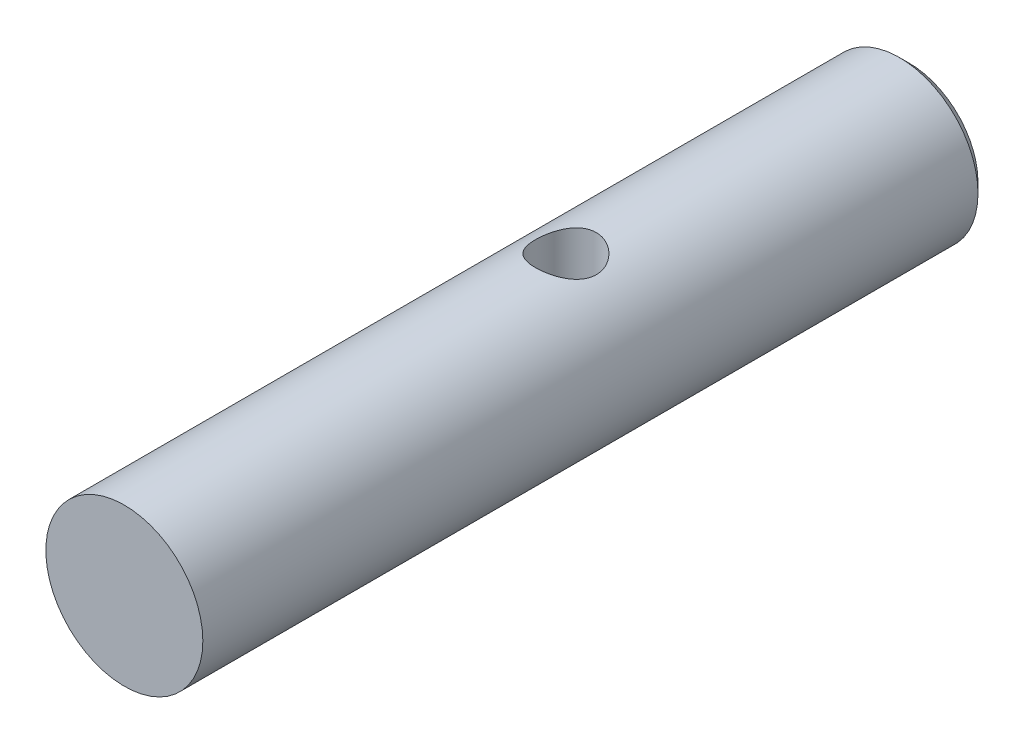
ISO-10303-21;
HEADER;
FILE_DESCRIPTION(('STEP AP214'),'2;1');
FILE_NAME('part.step','',(''),(''),'','','');
FILE_SCHEMA(('AUTOMOTIVE_DESIGN { 1 0 10303 214 1 1 1 1 }'));
ENDSEC;
DATA;
#1=APPLICATION_CONTEXT('core data for automotive mechanical design processes');
#2=APPLICATION_PROTOCOL_DEFINITION('international standard','automotive_design',2000,#1);
#3=PRODUCT_CONTEXT('',#1,'mechanical');
#4=PRODUCT('Part','Part','',(#3));
#5=PRODUCT_RELATED_PRODUCT_CATEGORY('part','',(#4));
#6=PRODUCT_DEFINITION_FORMATION('','',#4);
#7=PRODUCT_DEFINITION_CONTEXT('part definition',#1,'design');
#8=PRODUCT_DEFINITION('design','',#6,#7);
#9=PRODUCT_DEFINITION_SHAPE('','',#8);
#10=(LENGTH_UNIT() NAMED_UNIT(*) SI_UNIT(.MILLI.,.METRE.));
#11=(NAMED_UNIT(*) PLANE_ANGLE_UNIT() SI_UNIT($,.RADIAN.));
#12=(NAMED_UNIT(*) SI_UNIT($,.STERADIAN.) SOLID_ANGLE_UNIT());
#13=UNCERTAINTY_MEASURE_WITH_UNIT(LENGTH_MEASURE(1.E-05),#10,'distance_accuracy_value','');
#14=(GEOMETRIC_REPRESENTATION_CONTEXT(3) GLOBAL_UNCERTAINTY_ASSIGNED_CONTEXT((#13)) GLOBAL_UNIT_ASSIGNED_CONTEXT((#10,
#11,#12)) REPRESENTATION_CONTEXT('',''));
#15=CARTESIAN_POINT('',(0.,0.,0.));
#16=DIRECTION('',(0.,0.,1.));
#17=DIRECTION('',(1.,0.,0.));
#18=AXIS2_PLACEMENT_3D('',#15,#16,#17);
#19=CARTESIAN_POINT('',(0.,0.,40.));
#20=DIRECTION('',(0.,0.,-1.));
#21=DIRECTION('',(-1.,0.,0.));
#22=AXIS2_PLACEMENT_3D('',#19,#20,#21);
#23=CYLINDRICAL_SURFACE('',#22,4.);
#24=CARTESIAN_POINT('',(0.,-4.,19.05));
#25=CARTESIAN_POINT('',(0.0837418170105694,-4.00000307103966,19.0500040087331));
#26=CARTESIAN_POINT('',(0.167457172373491,-3.9973478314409,19.0431926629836));
#27=CARTESIAN_POINT('',(0.332375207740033,-3.98702237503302,19.0162464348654));
#28=CARTESIAN_POINT('',(0.413578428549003,-3.97935324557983,18.9961144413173));
#29=CARTESIAN_POINT('',(0.571068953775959,-3.95981985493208,18.9433531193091));
#30=CARTESIAN_POINT('',(0.647365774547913,-3.94796402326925,18.9107488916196));
#31=CARTESIAN_POINT('',(0.793397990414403,-3.92122905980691,18.8341007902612));
#32=CARTESIAN_POINT('',(0.86313149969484,-3.9063490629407,18.7900536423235));
#33=CARTESIAN_POINT('',(0.997188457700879,-3.8743461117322,18.689708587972));
#34=CARTESIAN_POINT('',(1.06117882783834,-3.85715676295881,18.6329870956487));
#35=CARTESIAN_POINT('',(1.17901131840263,-3.82278777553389,18.5098027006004));
#36=CARTESIAN_POINT('',(1.23285001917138,-3.80560814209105,18.4433365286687));
#37=CARTESIAN_POINT('',(1.33104129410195,-3.77241707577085,18.2992114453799));
#38=CARTESIAN_POINT('',(1.37491107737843,-3.75648304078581,18.2212039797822));
#39=CARTESIAN_POINT('',(1.44875905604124,-3.7286279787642,18.0582048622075));
#40=CARTESIAN_POINT('',(1.47874322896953,-3.71670522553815,17.9732162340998));
#41=CARTESIAN_POINT('',(1.52263359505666,-3.69893619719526,17.8025108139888));
#42=CARTESIAN_POINT('',(1.53717845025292,-3.69284964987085,17.7169841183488));
#43=CARTESIAN_POINT('',(1.55177347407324,-3.686742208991,17.5445039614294));
#44=CARTESIAN_POINT('',(1.55183016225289,-3.6867185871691,17.4575511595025));
#45=CARTESIAN_POINT('',(1.53793335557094,-3.69253360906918,17.2906718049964));
#46=CARTESIAN_POINT('',(1.52488463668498,-3.69799366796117,17.210654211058));
#47=CARTESIAN_POINT('',(1.48664952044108,-3.71352858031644,17.0540485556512));
#48=CARTESIAN_POINT('',(1.46146116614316,-3.72360417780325,16.977461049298));
#49=CARTESIAN_POINT('',(1.39919376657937,-3.74745019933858,16.8281119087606));
#50=CARTESIAN_POINT('',(1.36189037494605,-3.76128946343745,16.7554552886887));
#51=CARTESIAN_POINT('',(1.27660867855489,-3.79108253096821,16.6171778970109));
#52=CARTESIAN_POINT('',(1.22862651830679,-3.80703709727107,16.5515596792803));
#53=CARTESIAN_POINT('',(1.1192765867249,-3.84066621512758,16.4242405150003));
#54=CARTESIAN_POINT('',(1.05719282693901,-3.85838181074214,16.3631637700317));
#55=CARTESIAN_POINT('',(0.923467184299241,-3.89255270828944,16.2520960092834));
#56=CARTESIAN_POINT('',(0.851823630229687,-3.90900778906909,16.2021069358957));
#57=CARTESIAN_POINT('',(0.699332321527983,-3.93917140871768,16.1138816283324));
#58=CARTESIAN_POINT('',(0.618345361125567,-3.95282680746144,16.0758665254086));
#59=CARTESIAN_POINT('',(0.4504635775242,-3.97545468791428,16.0142112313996));
#60=CARTESIAN_POINT('',(0.363571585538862,-3.98442939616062,15.9905642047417));
#61=CARTESIAN_POINT('',(0.19158931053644,-3.99628616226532,15.9595469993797));
#62=CARTESIAN_POINT('',(0.106672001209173,-3.99948214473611,15.9513371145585));
#63=CARTESIAN_POINT('',(-0.0633780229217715,-4.0004007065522,15.9489652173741));
#64=CARTESIAN_POINT('',(-0.148510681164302,-3.99812459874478,15.9547998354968));
#65=CARTESIAN_POINT('',(-0.312858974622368,-3.98856115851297,15.9797230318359));
#66=CARTESIAN_POINT('',(-0.392173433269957,-3.98148622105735,15.9982501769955));
#67=CARTESIAN_POINT('',(-0.546503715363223,-3.96325324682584,16.0472811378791));
#68=CARTESIAN_POINT('',(-0.621518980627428,-3.95209468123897,16.0777865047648));
#69=CARTESIAN_POINT('',(-0.767652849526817,-3.92637006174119,16.1508947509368));
#70=CARTESIAN_POINT('',(-0.838586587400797,-3.91171167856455,16.1938336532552));
#71=CARTESIAN_POINT('',(-0.97248588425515,-3.88059327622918,16.2902139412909));
#72=CARTESIAN_POINT('',(-1.03544835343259,-3.86413256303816,16.3436593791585));
#73=CARTESIAN_POINT('',(-1.15570630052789,-3.82994670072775,16.4634276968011));
#74=CARTESIAN_POINT('',(-1.21240855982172,-3.81220642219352,16.5303434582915));
#75=CARTESIAN_POINT('',(-1.31391042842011,-3.7784267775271,16.6730730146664));
#76=CARTESIAN_POINT('',(-1.35870855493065,-3.76238762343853,16.7488879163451));
#77=CARTESIAN_POINT('',(-1.43528626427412,-3.73385097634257,16.9081328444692));
#78=CARTESIAN_POINT('',(-1.46697619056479,-3.72137804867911,16.991610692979));
#79=CARTESIAN_POINT('',(-1.51562246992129,-3.70183589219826,17.1633418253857));
#80=CARTESIAN_POINT('',(-1.53258879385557,-3.69476300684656,17.2515918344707));
#81=CARTESIAN_POINT('',(-1.55038415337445,-3.68732874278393,17.4238860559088));
#82=CARTESIAN_POINT('',(-1.55223359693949,-3.68654305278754,17.5078073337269));
#83=CARTESIAN_POINT('',(-1.54238929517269,-3.69067248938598,17.6747006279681));
#84=CARTESIAN_POINT('',(-1.53069702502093,-3.69558699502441,17.7576727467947));
#85=CARTESIAN_POINT('',(-1.49491544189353,-3.71019928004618,17.9173658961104));
#86=CARTESIAN_POINT('',(-1.471271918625,-3.7197245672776,17.9942039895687));
#87=CARTESIAN_POINT('',(-1.41266354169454,-3.74237408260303,18.1428607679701));
#88=CARTESIAN_POINT('',(-1.37769573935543,-3.7554992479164,18.214678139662));
#89=CARTESIAN_POINT('',(-1.29520837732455,-3.7847652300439,18.3555456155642));
#90=CARTESIAN_POINT('',(-1.24710518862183,-3.80103203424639,18.4242274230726));
#91=CARTESIAN_POINT('',(-1.1405907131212,-3.83434014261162,18.5528684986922));
#92=CARTESIAN_POINT('',(-1.08217604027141,-3.85138169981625,18.6128248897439));
#93=CARTESIAN_POINT('',(-0.952559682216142,-3.88553398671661,18.7259513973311));
#94=CARTESIAN_POINT('',(-0.880804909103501,-3.90258881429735,18.778507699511));
#95=CARTESIAN_POINT('',(-0.728878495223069,-3.93379551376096,18.8708166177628));
#96=CARTESIAN_POINT('',(-0.648705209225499,-3.94794681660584,18.9105667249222));
#97=CARTESIAN_POINT('',(-0.476070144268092,-3.97259068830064,18.978190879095));
#98=CARTESIAN_POINT('',(-0.383139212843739,-3.9827464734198,19.0050038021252));
#99=CARTESIAN_POINT('',(-0.193458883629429,-3.99644738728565,19.0409007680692));
#100=CARTESIAN_POINT('',(-0.0967117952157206,-3.99999645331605,19.0499953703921));
#101=CARTESIAN_POINT('',(0.,-4.,19.05));
#102=B_SPLINE_CURVE_WITH_KNOTS('',3,(#24,#25,#26,#27,#28,#29,#30,#31,#32,#33,#34,#35,#36,#37,
#38,#39,#40,#41,#42,#43,#44,#45,#46,#47,#48,#49,#50,#51,#52,#53,#54,#55,#56,#57,#58,#59,#60,#61,
#62,#63,#64,#65,#66,#67,#68,#69,#70,#71,#72,#73,#74,#75,#76,#77,#78,#79,#80,#81,#82,#83,#84,#85,
#86,#87,#88,#89,#90,#91,#92,#93,#94,#95,#96,#97,#98,#99,#100,#101),.UNSPECIFIED.,.T.,.F.,(4,2,2,
2,2,2,2,2,2,2,2,2,2,2,2,2,2,2,2,2,2,2,2,2,2,2,2,2,2,2,2,2,2,2,2,2,2,2,4),(0.,0.250868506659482,
0.501682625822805,0.751994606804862,1.00237829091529,1.26289324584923,1.52349580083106,
1.79484593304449,2.06607914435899,2.32559405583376,2.58499218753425,2.82763403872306,
3.07031501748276,3.31777403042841,3.56532253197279,3.83073141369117,4.0961867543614,
4.36629046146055,4.63626556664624,4.89107530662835,5.14582391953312,5.38997552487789,
5.63415875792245,5.88568062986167,6.13729969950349,6.40451611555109,6.67176580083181,
6.94081432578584,7.20968050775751,7.46023414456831,7.71076048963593,7.95256448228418,
8.19443148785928,8.44957507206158,8.70480259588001,8.97517525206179,9.245600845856,
9.53549682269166,9.82521998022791),.UNSPECIFIED.);
#103=CARTESIAN_POINT('',(0.,-4.,19.05));
#104=VERTEX_POINT('',#103);
#105=EDGE_CURVE('E10',#104,#104,#102,.T.);
#106=ORIENTED_EDGE('',*,*,#105,.T.);
#107=EDGE_LOOP('',(#106));
#108=FACE_BOUND('',#107,.T.);
#109=CARTESIAN_POINT('',(0.,4.,19.05));
#110=CARTESIAN_POINT('',(-0.0837418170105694,4.00000307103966,19.0500040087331));
#111=CARTESIAN_POINT('',(-0.167457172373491,3.9973478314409,19.0431926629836));
#112=CARTESIAN_POINT('',(-0.332375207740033,3.98702237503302,19.0162464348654));
#113=CARTESIAN_POINT('',(-0.413578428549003,3.97935324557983,18.9961144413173));
#114=CARTESIAN_POINT('',(-0.571068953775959,3.95981985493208,18.9433531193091));
#115=CARTESIAN_POINT('',(-0.647365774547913,3.94796402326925,18.9107488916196));
#116=CARTESIAN_POINT('',(-0.793397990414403,3.92122905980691,18.8341007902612));
#117=CARTESIAN_POINT('',(-0.86313149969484,3.9063490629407,18.7900536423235));
#118=CARTESIAN_POINT('',(-0.997188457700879,3.8743461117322,18.689708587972));
#119=CARTESIAN_POINT('',(-1.06117882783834,3.85715676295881,18.6329870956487));
#120=CARTESIAN_POINT('',(-1.17901131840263,3.82278777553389,18.5098027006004));
#121=CARTESIAN_POINT('',(-1.23285001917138,3.80560814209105,18.4433365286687));
#122=CARTESIAN_POINT('',(-1.33104129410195,3.77241707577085,18.2992114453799));
#123=CARTESIAN_POINT('',(-1.37491107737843,3.75648304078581,18.2212039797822));
#124=CARTESIAN_POINT('',(-1.44875905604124,3.7286279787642,18.0582048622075));
#125=CARTESIAN_POINT('',(-1.47874322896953,3.71670522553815,17.9732162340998));
#126=CARTESIAN_POINT('',(-1.52263359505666,3.69893619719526,17.8025108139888));
#127=CARTESIAN_POINT('',(-1.53717845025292,3.69284964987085,17.7169841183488));
#128=CARTESIAN_POINT('',(-1.55177347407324,3.686742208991,17.5445039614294));
#129=CARTESIAN_POINT('',(-1.55183016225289,3.6867185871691,17.4575511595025));
#130=CARTESIAN_POINT('',(-1.53793335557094,3.69253360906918,17.2906718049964));
#131=CARTESIAN_POINT('',(-1.52488463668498,3.69799366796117,17.210654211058));
#132=CARTESIAN_POINT('',(-1.48664952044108,3.71352858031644,17.0540485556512));
#133=CARTESIAN_POINT('',(-1.46146116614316,3.72360417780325,16.977461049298));
#134=CARTESIAN_POINT('',(-1.39919376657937,3.74745019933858,16.8281119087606));
#135=CARTESIAN_POINT('',(-1.36189037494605,3.76128946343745,16.7554552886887));
#136=CARTESIAN_POINT('',(-1.27660867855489,3.79108253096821,16.6171778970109));
#137=CARTESIAN_POINT('',(-1.22862651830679,3.80703709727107,16.5515596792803));
#138=CARTESIAN_POINT('',(-1.1192765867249,3.84066621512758,16.4242405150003));
#139=CARTESIAN_POINT('',(-1.05719282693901,3.85838181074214,16.3631637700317));
#140=CARTESIAN_POINT('',(-0.923467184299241,3.89255270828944,16.2520960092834));
#141=CARTESIAN_POINT('',(-0.851823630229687,3.90900778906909,16.2021069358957));
#142=CARTESIAN_POINT('',(-0.699332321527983,3.93917140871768,16.1138816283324));
#143=CARTESIAN_POINT('',(-0.618345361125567,3.95282680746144,16.0758665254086));
#144=CARTESIAN_POINT('',(-0.4504635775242,3.97545468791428,16.0142112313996));
#145=CARTESIAN_POINT('',(-0.363571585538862,3.98442939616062,15.9905642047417));
#146=CARTESIAN_POINT('',(-0.19158931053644,3.99628616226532,15.9595469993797));
#147=CARTESIAN_POINT('',(-0.106672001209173,3.99948214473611,15.9513371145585));
#148=CARTESIAN_POINT('',(0.0633780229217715,4.0004007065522,15.9489652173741));
#149=CARTESIAN_POINT('',(0.148510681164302,3.99812459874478,15.9547998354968));
#150=CARTESIAN_POINT('',(0.312858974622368,3.98856115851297,15.9797230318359));
#151=CARTESIAN_POINT('',(0.392173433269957,3.98148622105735,15.9982501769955));
#152=CARTESIAN_POINT('',(0.546503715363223,3.96325324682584,16.0472811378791));
#153=CARTESIAN_POINT('',(0.621518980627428,3.95209468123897,16.0777865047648));
#154=CARTESIAN_POINT('',(0.767652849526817,3.92637006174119,16.1508947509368));
#155=CARTESIAN_POINT('',(0.838586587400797,3.91171167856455,16.1938336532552));
#156=CARTESIAN_POINT('',(0.97248588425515,3.88059327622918,16.2902139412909));
#157=CARTESIAN_POINT('',(1.03544835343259,3.86413256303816,16.3436593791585));
#158=CARTESIAN_POINT('',(1.15570630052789,3.82994670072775,16.4634276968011));
#159=CARTESIAN_POINT('',(1.21240855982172,3.81220642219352,16.5303434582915));
#160=CARTESIAN_POINT('',(1.31391042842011,3.7784267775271,16.6730730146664));
#161=CARTESIAN_POINT('',(1.35870855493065,3.76238762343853,16.7488879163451));
#162=CARTESIAN_POINT('',(1.43528626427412,3.73385097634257,16.9081328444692));
#163=CARTESIAN_POINT('',(1.46697619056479,3.72137804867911,16.991610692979));
#164=CARTESIAN_POINT('',(1.51562246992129,3.70183589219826,17.1633418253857));
#165=CARTESIAN_POINT('',(1.53258879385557,3.69476300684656,17.2515918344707));
#166=CARTESIAN_POINT('',(1.55038415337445,3.68732874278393,17.4238860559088));
#167=CARTESIAN_POINT('',(1.55223359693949,3.68654305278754,17.5078073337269));
#168=CARTESIAN_POINT('',(1.54238929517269,3.69067248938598,17.6747006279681));
#169=CARTESIAN_POINT('',(1.53069702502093,3.69558699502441,17.7576727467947));
#170=CARTESIAN_POINT('',(1.49491544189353,3.71019928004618,17.9173658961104));
#171=CARTESIAN_POINT('',(1.471271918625,3.7197245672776,17.9942039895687));
#172=CARTESIAN_POINT('',(1.41266354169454,3.74237408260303,18.1428607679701));
#173=CARTESIAN_POINT('',(1.37769573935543,3.7554992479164,18.214678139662));
#174=CARTESIAN_POINT('',(1.29520837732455,3.7847652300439,18.3555456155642));
#175=CARTESIAN_POINT('',(1.24710518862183,3.80103203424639,18.4242274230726));
#176=CARTESIAN_POINT('',(1.1405907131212,3.83434014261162,18.5528684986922));
#177=CARTESIAN_POINT('',(1.08217604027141,3.85138169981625,18.6128248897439));
#178=CARTESIAN_POINT('',(0.952559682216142,3.88553398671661,18.7259513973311));
#179=CARTESIAN_POINT('',(0.880804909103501,3.90258881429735,18.778507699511));
#180=CARTESIAN_POINT('',(0.728878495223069,3.93379551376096,18.8708166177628));
#181=CARTESIAN_POINT('',(0.648705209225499,3.94794681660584,18.9105667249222));
#182=CARTESIAN_POINT('',(0.476070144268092,3.97259068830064,18.978190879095));
#183=CARTESIAN_POINT('',(0.383139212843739,3.9827464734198,19.0050038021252));
#184=CARTESIAN_POINT('',(0.193458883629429,3.99644738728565,19.0409007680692));
#185=CARTESIAN_POINT('',(0.0967117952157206,3.99999645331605,19.0499953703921));
#186=CARTESIAN_POINT('',(0.,4.,19.05));
#187=B_SPLINE_CURVE_WITH_KNOTS('',3,(#109,#110,#111,#112,#113,#114,#115,#116,#117,#118,#119,
#120,#121,#122,#123,#124,#125,#126,#127,#128,#129,#130,#131,#132,#133,#134,#135,#136,#137,#138,
#139,#140,#141,#142,#143,#144,#145,#146,#147,#148,#149,#150,#151,#152,#153,#154,#155,#156,#157,
#158,#159,#160,#161,#162,#163,#164,#165,#166,#167,#168,#169,#170,#171,#172,#173,#174,#175,#176,
#177,#178,#179,#180,#181,#182,#183,#184,#185,#186),.UNSPECIFIED.,.T.,.F.,(4,2,2,2,2,2,2,2,2,2,2,
2,2,2,2,2,2,2,2,2,2,2,2,2,2,2,2,2,2,2,2,2,2,2,2,2,2,2,4),(0.,0.250868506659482,
0.501682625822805,0.751994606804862,1.00237829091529,1.26289324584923,1.52349580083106,
1.79484593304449,2.06607914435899,2.32559405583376,2.58499218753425,2.82763403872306,
3.07031501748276,3.31777403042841,3.56532253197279,3.83073141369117,4.0961867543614,
4.36629046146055,4.63626556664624,4.89107530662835,5.14582391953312,5.38997552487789,
5.63415875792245,5.88568062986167,6.13729969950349,6.40451611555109,6.67176580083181,
6.94081432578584,7.20968050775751,7.46023414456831,7.71076048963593,7.95256448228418,
8.19443148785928,8.44957507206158,8.70480259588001,8.97517525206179,9.245600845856,
9.53549682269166,9.82521998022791),.UNSPECIFIED.);
#188=CARTESIAN_POINT('',(0.,4.,19.05));
#189=VERTEX_POINT('',#188);
#190=EDGE_CURVE('E40',#189,#189,#187,.T.);
#191=ORIENTED_EDGE('',*,*,#190,.T.);
#192=EDGE_LOOP('',(#191));
#193=FACE_BOUND('',#192,.T.);
#194=CARTESIAN_POINT('',(0.,0.,0.5));
#195=DIRECTION('',(0.,0.,1.));
#196=DIRECTION('',(1.,0.,0.));
#197=AXIS2_PLACEMENT_3D('',#194,#195,#196);
#198=CIRCLE('',#197,4.);
#199=CARTESIAN_POINT('',(4.,0.,0.5));
#200=VERTEX_POINT('',#199);
#201=EDGE_CURVE('E48',#200,#200,#198,.T.);
#202=ORIENTED_EDGE('',*,*,#201,.T.);
#203=EDGE_LOOP('',(#202));
#204=FACE_BOUND('',#203,.T.);
#205=CARTESIAN_POINT('',(0.,0.,40.));
#206=DIRECTION('',(0.,0.,1.));
#207=DIRECTION('',(1.,0.,0.));
#208=AXIS2_PLACEMENT_3D('',#205,#206,#207);
#209=CIRCLE('',#208,4.);
#210=CARTESIAN_POINT('',(4.,0.,40.));
#211=VERTEX_POINT('',#210);
#212=EDGE_CURVE('E75',#211,#211,#209,.T.);
#213=ORIENTED_EDGE('',*,*,#212,.F.);
#214=EDGE_LOOP('',(#213));
#215=FACE_BOUND('',#214,.T.);
#216=ADVANCED_FACE('F29',(#108,#193,#204,#215),#23,.T.);
#217=CARTESIAN_POINT('',(0.,0.,40.));
#218=DIRECTION('',(0.,0.,1.));
#219=DIRECTION('',(1.,0.,0.));
#220=AXIS2_PLACEMENT_3D('',#217,#218,#219);
#221=PLANE('',#220);
#222=ORIENTED_EDGE('',*,*,#212,.T.);
#223=EDGE_LOOP('',(#222));
#224=FACE_BOUND('',#223,.T.);
#225=ADVANCED_FACE('F66',(#224),#221,.T.);
#226=CARTESIAN_POINT('',(0.,0.,0.));
#227=DIRECTION('',(0.,0.,1.));
#228=DIRECTION('',(1.,0.,0.));
#229=AXIS2_PLACEMENT_3D('',#226,#227,#228);
#230=PLANE('',#229);
#231=CARTESIAN_POINT('',(0.,0.,0.));
#232=DIRECTION('',(0.,0.,1.));
#233=DIRECTION('',(1.,0.,0.));
#234=AXIS2_PLACEMENT_3D('',#231,#232,#233);
#235=CIRCLE('',#234,3.5);
#236=CARTESIAN_POINT('',(3.5,0.,0.));
#237=VERTEX_POINT('',#236);
#238=EDGE_CURVE('E44',#237,#237,#235,.F.);
#239=ORIENTED_EDGE('',*,*,#238,.T.);
#240=EDGE_LOOP('',(#239));
#241=FACE_BOUND('',#240,.T.);
#242=ADVANCED_FACE('F63',(#241),#230,.F.);
#243=CARTESIAN_POINT('',(0.,0.,0.5));
#244=DIRECTION('',(0.,0.,1.));
#245=DIRECTION('',(1.,0.,0.));
#246=AXIS2_PLACEMENT_3D('',#243,#244,#245);
#247=CONICAL_SURFACE('',#246,4.,0.785398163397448);
#248=ORIENTED_EDGE('',*,*,#238,.F.);
#249=EDGE_LOOP('',(#248));
#250=FACE_BOUND('',#249,.T.);
#251=ORIENTED_EDGE('',*,*,#201,.F.);
#252=EDGE_LOOP('',(#251));
#253=FACE_BOUND('',#252,.T.);
#254=ADVANCED_FACE('F58',(#250,#253),#247,.T.);
#255=CARTESIAN_POINT('',(0.,-4.,17.5));
#256=DIRECTION('',(0.,1.,0.));
#257=DIRECTION('',(0.,0.,1.));
#258=AXIS2_PLACEMENT_3D('',#255,#256,#257);
#259=CYLINDRICAL_SURFACE('',#258,1.55);
#260=ORIENTED_EDGE('',*,*,#190,.F.);
#261=EDGE_LOOP('',(#260));
#262=FACE_BOUND('',#261,.T.);
#263=ORIENTED_EDGE('',*,*,#105,.F.);
#264=EDGE_LOOP('',(#263));
#265=FACE_BOUND('',#264,.T.);
#266=ADVANCED_FACE('F54',(#262,#265),#259,.F.);
#267=CLOSED_SHELL('',(#216,#225,#242,#254,#266));
#268=MANIFOLD_SOLID_BREP('B2',#267);
#269=ADVANCED_BREP_SHAPE_REPRESENTATION('',(#18,#268),#14);
#270=SHAPE_DEFINITION_REPRESENTATION(#9,#269);
ENDSEC;
END-ISO-10303-21;
